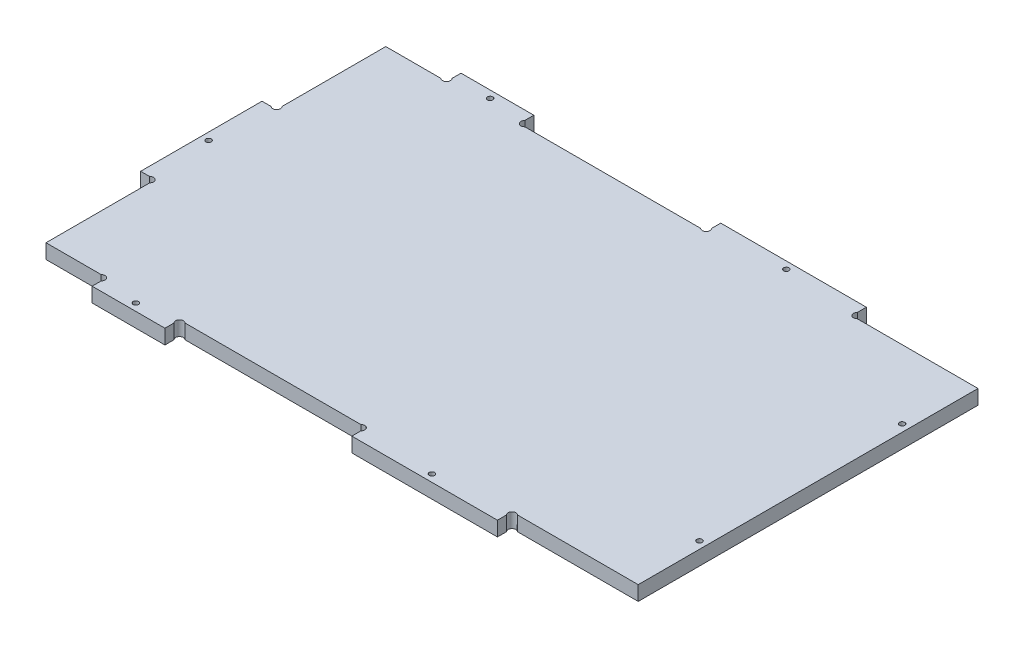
from build123d import *

# Parameters (mm, degrees)
ESQUISSE1_R        = 1.1
BOSS_EXTRU_1_DEPTH = 6


with BuildPart() as part:
    # Esquisse1 → Boss.-Extru.1 (new body)
    with BuildSketch(Plane(origin=(0, 0, 0), x_dir=(1, 0, 0), z_dir=(0, 1, 0))):
        with BuildLine():
            Line((3.7372583, 101), (0, 101))
            Line((0, 101), (0, 51))
            Line((0, 51), (3.7372583, 51))
            ThreePointArc((3.7372583, 51), (6, 51), (6, 48.7372583))
            Line((6, 48.7372583), (6, 6))
            Line((6, 6), (28.7372583, 6))
            ThreePointArc((28.7372583, 6), (31, 6), (31, 3.7372583))
            Line((31, 3.7372583), (31, 0))
            Line((31, 0), (61, 0))
            Line((61, 0), (61, 3.7372583))
            ThreePointArc((61, 3.7372583), (61, 6), (63.2627417, 6))
            Line((63.2627417, 6), (135.7372583, 6))
            ThreePointArc((135.7372583, 6), (138, 6), (138, 3.7372583))
            Line((138, 3.7372583), (138, 0))
            Line((138, 0), (198, 0))
            Line((198, 0), (198, 3.7372583))
            ThreePointArc((198, 3.7372583), (198, 6), (200.2627417, 6))
            Line((200.2627417, 6), (250, 6))
            Line((250, 6), (250, 146))
            Line((250, 146), (200.2627417, 146))
            ThreePointArc((200.2627417, 146), (198, 146), (198, 148.2627417))
            Line((198, 148.2627417), (198, 152))
            Line((198, 152), (138, 152))
            Line((138, 152), (138, 148.2627417))
            ThreePointArc((138, 148.2627417), (138, 146), (135.7372583, 146))
            Line((135.7372583, 146), (63.2627417, 146))
            ThreePointArc((63.2627417, 146), (61, 146), (61, 148.2627417))
            Line((61, 148.2627417), (61, 152))
            Line((61, 152), (31, 152))
            Line((31, 152), (31, 148.2627417))
            ThreePointArc((31, 148.2627417), (31, 146), (28.7372583, 146))
            Line((28.7372583, 146), (6, 146))
            Line((6, 146), (6, 103.2627417))
            ThreePointArc((6, 103.2627417), (6, 101), (3.7372583, 101))
        make_face()
        with Locations(Location((247, 34.25, 0), (0, 0, 270))):
            Circle(ESQUISSE1_R, mode=Mode.SUBTRACT)
        with Locations(Location((247, 117.75, 0), (0, 0, 90))):
            Circle(ESQUISSE1_R, mode=Mode.SUBTRACT)
        with Locations(Location((46, 149, 0), (0, 0, 270))):
            Circle(ESQUISSE1_R, mode=Mode.SUBTRACT)
        with Locations(Location((3, 76, 0), (0, 0, 270))):
            Circle(ESQUISSE1_R, mode=Mode.SUBTRACT)
        with Locations(Location((168, 149, 0), (0, 0, 270))):
            Circle(ESQUISSE1_R, mode=Mode.SUBTRACT)
        with Locations(Location((168, 3, 0), (0, 0, 90))):
            Circle(ESQUISSE1_R, mode=Mode.SUBTRACT)
        with Locations(Location((46, 3, 0), (0, 0, 90))):
            Circle(ESQUISSE1_R, mode=Mode.SUBTRACT)
    extrude(amount=BOSS_EXTRU_1_DEPTH)


solid = part.part
